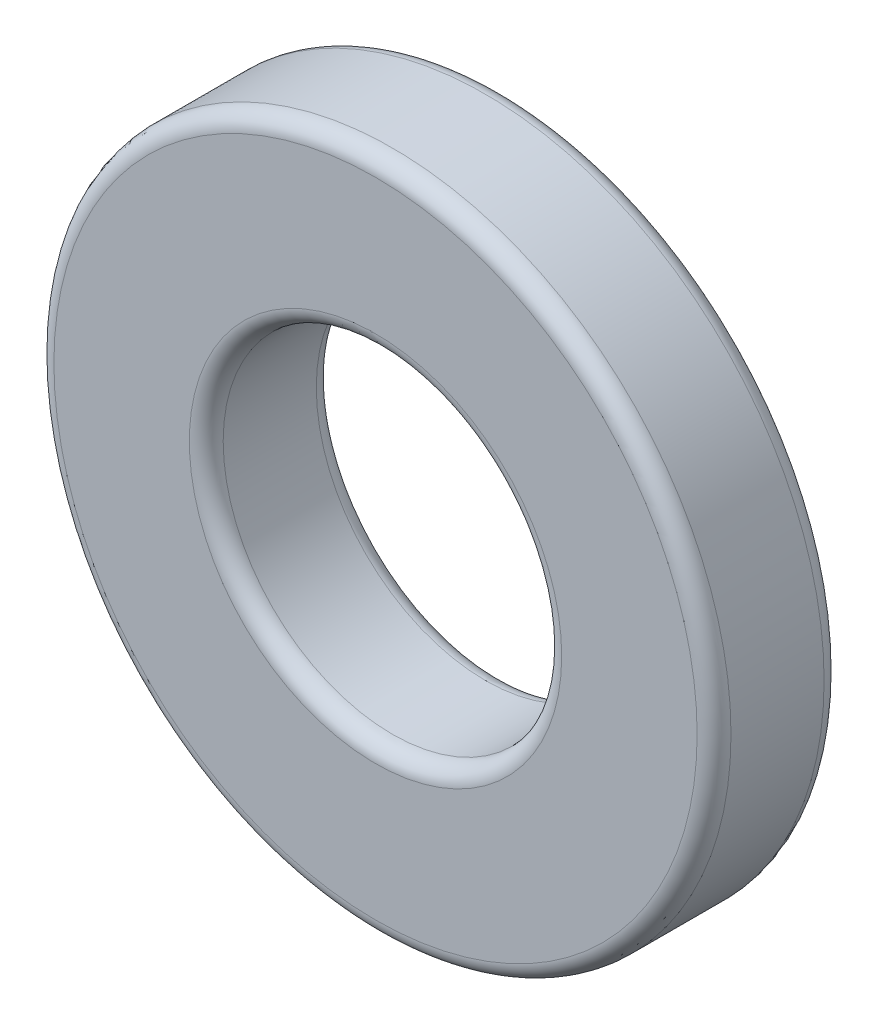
ISO-10303-21;
HEADER;
FILE_DESCRIPTION(('STEP AP214'),'2;1');
FILE_NAME('part.step','',(''),(''),'','','');
FILE_SCHEMA(('AUTOMOTIVE_DESIGN { 1 0 10303 214 1 1 1 1 }'));
ENDSEC;
DATA;
#1=APPLICATION_CONTEXT('core data for automotive mechanical design processes');
#2=APPLICATION_PROTOCOL_DEFINITION('international standard','automotive_design',2000,#1);
#3=PRODUCT_CONTEXT('',#1,'mechanical');
#4=PRODUCT('Part','Part','',(#3));
#5=PRODUCT_RELATED_PRODUCT_CATEGORY('part','',(#4));
#6=PRODUCT_DEFINITION_FORMATION('','',#4);
#7=PRODUCT_DEFINITION_CONTEXT('part definition',#1,'design');
#8=PRODUCT_DEFINITION('design','',#6,#7);
#9=PRODUCT_DEFINITION_SHAPE('','',#8);
#10=(LENGTH_UNIT() NAMED_UNIT(*) SI_UNIT(.MILLI.,.METRE.));
#11=(NAMED_UNIT(*) PLANE_ANGLE_UNIT() SI_UNIT($,.RADIAN.));
#12=(NAMED_UNIT(*) SI_UNIT($,.STERADIAN.) SOLID_ANGLE_UNIT());
#13=UNCERTAINTY_MEASURE_WITH_UNIT(LENGTH_MEASURE(1.E-05),#10,'distance_accuracy_value','');
#14=(GEOMETRIC_REPRESENTATION_CONTEXT(3) GLOBAL_UNCERTAINTY_ASSIGNED_CONTEXT((#13)) GLOBAL_UNIT_ASSIGNED_CONTEXT((#10,
#11,#12)) REPRESENTATION_CONTEXT('',''));
#15=CARTESIAN_POINT('',(0.,0.,0.));
#16=DIRECTION('',(0.,0.,1.));
#17=DIRECTION('',(1.,0.,0.));
#18=AXIS2_PLACEMENT_3D('',#15,#16,#17);
#19=CARTESIAN_POINT('',(0.,0.,1.5));
#20=DIRECTION('',(0.,0.,1.));
#21=DIRECTION('',(1.,0.,0.));
#22=AXIS2_PLACEMENT_3D('',#19,#20,#21);
#23=PLANE('',#22);
#24=CARTESIAN_POINT('',(0.,0.,1.5));
#25=DIRECTION('',(0.,0.,1.));
#26=DIRECTION('',(1.,0.,0.));
#27=AXIS2_PLACEMENT_3D('',#24,#25,#26);
#28=CIRCLE('',#27,2.2);
#29=CARTESIAN_POINT('',(2.2,0.,1.5));
#30=VERTEX_POINT('',#29);
#31=EDGE_CURVE('E42',#30,#30,#28,.F.);
#32=ORIENTED_EDGE('',*,*,#31,.T.);
#33=EDGE_LOOP('',(#32));
#34=FACE_BOUND('',#33,.T.);
#35=CARTESIAN_POINT('',(0.,0.,1.5));
#36=DIRECTION('',(0.,0.,1.));
#37=DIRECTION('',(1.,0.,0.));
#38=AXIS2_PLACEMENT_3D('',#35,#36,#37);
#39=CIRCLE('',#38,3.8);
#40=CARTESIAN_POINT('',(3.8,0.,1.5));
#41=VERTEX_POINT('',#40);
#42=EDGE_CURVE('E46',#41,#41,#39,.T.);
#43=ORIENTED_EDGE('',*,*,#42,.T.);
#44=EDGE_LOOP('',(#43));
#45=FACE_BOUND('',#44,.T.);
#46=ADVANCED_FACE('F31',(#34,#45),#23,.T.);
#47=CARTESIAN_POINT('',(0.,0.,0.));
#48=DIRECTION('',(0.,0.,1.));
#49=DIRECTION('',(1.,0.,0.));
#50=AXIS2_PLACEMENT_3D('',#47,#48,#49);
#51=PLANE('',#50);
#52=CARTESIAN_POINT('',(0.,0.,0.));
#53=DIRECTION('',(0.,0.,1.));
#54=DIRECTION('',(1.,0.,0.));
#55=AXIS2_PLACEMENT_3D('',#52,#53,#54);
#56=CIRCLE('',#55,2.2);
#57=CARTESIAN_POINT('',(2.2,0.,0.));
#58=VERTEX_POINT('',#57);
#59=EDGE_CURVE('E57',#58,#58,#56,.T.);
#60=ORIENTED_EDGE('',*,*,#59,.T.);
#61=EDGE_LOOP('',(#60));
#62=FACE_BOUND('',#61,.T.);
#63=CARTESIAN_POINT('',(0.,0.,0.));
#64=DIRECTION('',(0.,0.,1.));
#65=DIRECTION('',(1.,0.,0.));
#66=AXIS2_PLACEMENT_3D('',#63,#64,#65);
#67=CIRCLE('',#66,3.8);
#68=CARTESIAN_POINT('',(3.8,0.,0.));
#69=VERTEX_POINT('',#68);
#70=EDGE_CURVE('E60',#69,#69,#67,.F.);
#71=ORIENTED_EDGE('',*,*,#70,.T.);
#72=EDGE_LOOP('',(#71));
#73=FACE_BOUND('',#72,.T.);
#74=ADVANCED_FACE('F64',(#62,#73),#51,.F.);
#75=CARTESIAN_POINT('',(0.,0.,1.5));
#76=DIRECTION('',(0.,0.,-1.));
#77=DIRECTION('',(-1.,0.,0.));
#78=AXIS2_PLACEMENT_3D('',#75,#76,#77);
#79=CYLINDRICAL_SURFACE('',#78,4.);
#80=CARTESIAN_POINT('',(0.,0.,0.2));
#81=DIRECTION('',(0.,0.,1.));
#82=DIRECTION('',(1.,0.,0.));
#83=AXIS2_PLACEMENT_3D('',#80,#81,#82);
#84=CIRCLE('',#83,4.);
#85=CARTESIAN_POINT('',(4.,0.,0.2));
#86=VERTEX_POINT('',#85);
#87=EDGE_CURVE('E10',#86,#86,#84,.T.);
#88=ORIENTED_EDGE('',*,*,#87,.T.);
#89=EDGE_LOOP('',(#88));
#90=FACE_BOUND('',#89,.T.);
#91=CARTESIAN_POINT('',(0.,0.,1.3));
#92=DIRECTION('',(0.,0.,1.));
#93=DIRECTION('',(1.,0.,0.));
#94=AXIS2_PLACEMENT_3D('',#91,#92,#93);
#95=CIRCLE('',#94,4.);
#96=CARTESIAN_POINT('',(4.,0.,1.3));
#97=VERTEX_POINT('',#96);
#98=EDGE_CURVE('E38',#97,#97,#95,.F.);
#99=ORIENTED_EDGE('',*,*,#98,.T.);
#100=EDGE_LOOP('',(#99));
#101=FACE_BOUND('',#100,.T.);
#102=ADVANCED_FACE('F84',(#90,#101),#79,.T.);
#103=CARTESIAN_POINT('',(0.,0.,1.5));
#104=DIRECTION('',(0.,0.,-1.));
#105=DIRECTION('',(-1.,0.,0.));
#106=AXIS2_PLACEMENT_3D('',#103,#104,#105);
#107=CYLINDRICAL_SURFACE('',#106,2.);
#108=CARTESIAN_POINT('',(0.,0.,0.2));
#109=DIRECTION('',(0.,0.,1.));
#110=DIRECTION('',(1.,0.,0.));
#111=AXIS2_PLACEMENT_3D('',#108,#109,#110);
#112=CIRCLE('',#111,2.);
#113=CARTESIAN_POINT('',(2.,0.,0.2));
#114=VERTEX_POINT('',#113);
#115=EDGE_CURVE('E51',#114,#114,#112,.F.);
#116=ORIENTED_EDGE('',*,*,#115,.T.);
#117=EDGE_LOOP('',(#116));
#118=FACE_BOUND('',#117,.T.);
#119=CARTESIAN_POINT('',(0.,0.,1.3));
#120=DIRECTION('',(0.,0.,1.));
#121=DIRECTION('',(1.,0.,0.));
#122=AXIS2_PLACEMENT_3D('',#119,#120,#121);
#123=CIRCLE('',#122,2.);
#124=CARTESIAN_POINT('',(2.,0.,1.3));
#125=VERTEX_POINT('',#124);
#126=EDGE_CURVE('E54',#125,#125,#123,.T.);
#127=ORIENTED_EDGE('',*,*,#126,.T.);
#128=EDGE_LOOP('',(#127));
#129=FACE_BOUND('',#128,.T.);
#130=ADVANCED_FACE('F89',(#118,#129),#107,.F.);
#131=CARTESIAN_POINT('',(0.,0.,0.2));
#132=DIRECTION('',(0.,0.,1.));
#133=DIRECTION('',(1.,0.,0.));
#134=AXIS2_PLACEMENT_3D('',#131,#132,#133);
#135=TOROIDAL_SURFACE('',#134,2.2,0.2);
#136=ORIENTED_EDGE('',*,*,#115,.F.);
#137=EDGE_LOOP('',(#136));
#138=FACE_BOUND('',#137,.T.);
#139=ORIENTED_EDGE('',*,*,#59,.F.);
#140=EDGE_LOOP('',(#139));
#141=FACE_BOUND('',#140,.T.);
#142=ADVANCED_FACE('F75',(#138,#141),#135,.T.);
#143=CARTESIAN_POINT('',(0.,0.,1.3));
#144=DIRECTION('',(0.,0.,1.));
#145=DIRECTION('',(1.,0.,0.));
#146=AXIS2_PLACEMENT_3D('',#143,#144,#145);
#147=TOROIDAL_SURFACE('',#146,2.2,0.2);
#148=ORIENTED_EDGE('',*,*,#31,.F.);
#149=EDGE_LOOP('',(#148));
#150=FACE_BOUND('',#149,.T.);
#151=ORIENTED_EDGE('',*,*,#126,.F.);
#152=EDGE_LOOP('',(#151));
#153=FACE_BOUND('',#152,.T.);
#154=ADVANCED_FACE('F69',(#150,#153),#147,.T.);
#155=CARTESIAN_POINT('',(0.,0.,0.2));
#156=DIRECTION('',(0.,0.,1.));
#157=DIRECTION('',(1.,0.,0.));
#158=AXIS2_PLACEMENT_3D('',#155,#156,#157);
#159=TOROIDAL_SURFACE('',#158,3.8,0.2);
#160=ORIENTED_EDGE('',*,*,#70,.F.);
#161=EDGE_LOOP('',(#160));
#162=FACE_BOUND('',#161,.T.);
#163=ORIENTED_EDGE('',*,*,#87,.F.);
#164=EDGE_LOOP('',(#163));
#165=FACE_BOUND('',#164,.T.);
#166=ADVANCED_FACE('F66',(#162,#165),#159,.T.);
#167=CARTESIAN_POINT('',(0.,0.,1.3));
#168=DIRECTION('',(0.,0.,1.));
#169=DIRECTION('',(1.,0.,0.));
#170=AXIS2_PLACEMENT_3D('',#167,#168,#169);
#171=TOROIDAL_SURFACE('',#170,3.8,0.2);
#172=ORIENTED_EDGE('',*,*,#98,.F.);
#173=EDGE_LOOP('',(#172));
#174=FACE_BOUND('',#173,.T.);
#175=ORIENTED_EDGE('',*,*,#42,.F.);
#176=EDGE_LOOP('',(#175));
#177=FACE_BOUND('',#176,.T.);
#178=ADVANCED_FACE('F33',(#174,#177),#171,.T.);
#179=CLOSED_SHELL('',(#46,#74,#102,#130,#142,#154,#166,#178));
#180=MANIFOLD_SOLID_BREP('B2',#179);
#181=ADVANCED_BREP_SHAPE_REPRESENTATION('',(#18,#180),#14);
#182=SHAPE_DEFINITION_REPRESENTATION(#9,#181);
ENDSEC;
END-ISO-10303-21;
